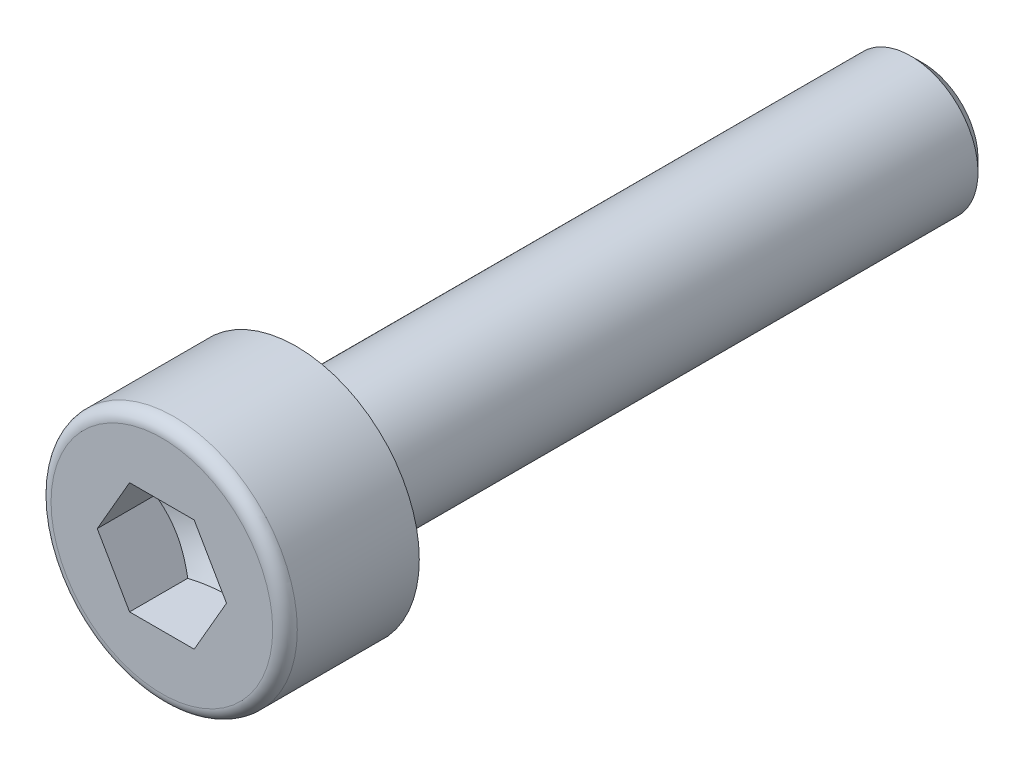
ISO-10303-21;
HEADER;
FILE_DESCRIPTION(('STEP AP214'),'2;1');
FILE_NAME('part.step','',(''),(''),'','','');
FILE_SCHEMA(('AUTOMOTIVE_DESIGN { 1 0 10303 214 1 1 1 1 }'));
ENDSEC;
DATA;
#1=APPLICATION_CONTEXT('core data for automotive mechanical design processes');
#2=APPLICATION_PROTOCOL_DEFINITION('international standard','automotive_design',2000,#1);
#3=PRODUCT_CONTEXT('',#1,'mechanical');
#4=PRODUCT('Part','Part','',(#3));
#5=PRODUCT_RELATED_PRODUCT_CATEGORY('part','',(#4));
#6=PRODUCT_DEFINITION_FORMATION('','',#4);
#7=PRODUCT_DEFINITION_CONTEXT('part definition',#1,'design');
#8=PRODUCT_DEFINITION('design','',#6,#7);
#9=PRODUCT_DEFINITION_SHAPE('','',#8);
#10=(LENGTH_UNIT() NAMED_UNIT(*) SI_UNIT(.MILLI.,.METRE.));
#11=(NAMED_UNIT(*) PLANE_ANGLE_UNIT() SI_UNIT($,.RADIAN.));
#12=(NAMED_UNIT(*) SI_UNIT($,.STERADIAN.) SOLID_ANGLE_UNIT());
#13=UNCERTAINTY_MEASURE_WITH_UNIT(LENGTH_MEASURE(1.E-05),#10,'distance_accuracy_value','');
#14=(GEOMETRIC_REPRESENTATION_CONTEXT(3) GLOBAL_UNCERTAINTY_ASSIGNED_CONTEXT((#13)) GLOBAL_UNIT_ASSIGNED_CONTEXT((#10,
#11,#12)) REPRESENTATION_CONTEXT('',''));
#15=CARTESIAN_POINT('',(0.,0.,0.));
#16=DIRECTION('',(0.,0.,1.));
#17=DIRECTION('',(1.,0.,0.));
#18=AXIS2_PLACEMENT_3D('',#15,#16,#17);
#19=CARTESIAN_POINT('',(0.,1.2375,3.));
#20=DIRECTION('',(0.,0.,1.));
#21=DIRECTION('',(1.,0.,0.));
#22=AXIS2_PLACEMENT_3D('',#19,#20,#21);
#23=PLANE('',#22);
#24=DIRECTION('',(-0.5,0.866025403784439,0.));
#25=VECTOR('',#24,1.);
#26=CARTESIAN_POINT('',(-1.35045785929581,-0.160937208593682,3.));
#27=LINE('',#26,#25);
#28=CARTESIAN_POINT('',(-0.7216875,-1.24999941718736,3.));
#29=VERTEX_POINT('',#28);
#30=CARTESIAN_POINT('',(-1.443375,0.,3.));
#31=VERTEX_POINT('',#30);
#32=EDGE_CURVE('E145',#29,#31,#27,.T.);
#33=ORIENTED_EDGE('',*,*,#32,.T.);
#34=DIRECTION('',(0.5,0.866025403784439,0.));
#35=VECTOR('',#34,1.);
#36=CARTESIAN_POINT('',(-0.81460464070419,1.08906220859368,3.));
#37=LINE('',#36,#35);
#38=CARTESIAN_POINT('',(-0.7216875,1.24999941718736,3.));
#39=VERTEX_POINT('',#38);
#40=EDGE_CURVE('E10',#31,#39,#37,.T.);
#41=ORIENTED_EDGE('',*,*,#40,.T.);
#42=DIRECTION('',(1.,0.,0.));
#43=VECTOR('',#42,1.);
#44=CARTESIAN_POINT('',(0.,1.24999941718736,3.));
#45=LINE('',#44,#43);
#46=CARTESIAN_POINT('',(0.7216875,1.24999941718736,3.));
#47=VERTEX_POINT('',#46);
#48=EDGE_CURVE('E176',#39,#47,#45,.T.);
#49=ORIENTED_EDGE('',*,*,#48,.T.);
#50=DIRECTION('',(0.5,-0.866025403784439,0.));
#51=VECTOR('',#50,1.);
#52=CARTESIAN_POINT('',(0.814604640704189,1.08906220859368,3.));
#53=LINE('',#52,#51);
#54=CARTESIAN_POINT('',(1.443375,0.,3.));
#55=VERTEX_POINT('',#54);
#56=EDGE_CURVE('E172',#47,#55,#53,.T.);
#57=ORIENTED_EDGE('',*,*,#56,.T.);
#58=DIRECTION('',(-0.5,-0.866025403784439,0.));
#59=VECTOR('',#58,1.);
#60=CARTESIAN_POINT('',(1.35045785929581,-0.160937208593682,3.));
#61=LINE('',#60,#59);
#62=CARTESIAN_POINT('',(0.7216875,-1.24999941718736,3.));
#63=VERTEX_POINT('',#62);
#64=EDGE_CURVE('E173',#55,#63,#61,.T.);
#65=ORIENTED_EDGE('',*,*,#64,.T.);
#66=DIRECTION('',(-1.,0.,0.));
#67=VECTOR('',#66,1.);
#68=CARTESIAN_POINT('',(0.,-1.24999941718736,3.));
#69=LINE('',#68,#67);
#70=EDGE_CURVE('E147',#63,#29,#69,.T.);
#71=ORIENTED_EDGE('',*,*,#70,.T.);
#72=EDGE_LOOP('',(#33,#41,#49,#57,#65,#71));
#73=FACE_BOUND('',#72,.T.);
#74=CARTESIAN_POINT('',(0.,0.,3.));
#75=DIRECTION('',(0.,0.,-1.));
#76=DIRECTION('',(0.,1.,0.));
#77=AXIS2_PLACEMENT_3D('',#74,#75,#76);
#78=CIRCLE('',#77,2.475);
#79=CARTESIAN_POINT('',(2.475,0.,3.));
#80=VERTEX_POINT('',#79);
#81=EDGE_CURVE('E194',#80,#80,#78,.T.);
#82=ORIENTED_EDGE('',*,*,#81,.F.);
#83=EDGE_LOOP('',(#82));
#84=FACE_BOUND('',#83,.T.);
#85=ADVANCED_FACE('F16',(#73,#84),#23,.T.);
#86=CARTESIAN_POINT('',(0.,0.6146875,-14.));
#87=DIRECTION('',(0.,0.,-1.));
#88=DIRECTION('',(0.,-1.,0.));
#89=AXIS2_PLACEMENT_3D('',#86,#87,#88);
#90=PLANE('',#89);
#91=CARTESIAN_POINT('',(0.,0.,-14.));
#92=DIRECTION('',(0.,0.,-1.));
#93=DIRECTION('',(0.,1.,0.));
#94=AXIS2_PLACEMENT_3D('',#91,#92,#93);
#95=CIRCLE('',#94,1.229375);
#96=CARTESIAN_POINT('',(0.,-1.229375,-14.));
#97=VERTEX_POINT('',#96);
#98=EDGE_CURVE('E180',#97,#97,#95,.T.);
#99=ORIENTED_EDGE('',*,*,#98,.T.);
#100=EDGE_LOOP('',(#99));
#101=FACE_BOUND('',#100,.T.);
#102=ADVANCED_FACE('F281',(#101),#90,.T.);
#103=CARTESIAN_POINT('',(0.,2.2,0.));
#104=DIRECTION('',(0.,0.,-1.));
#105=DIRECTION('',(0.,-1.,0.));
#106=AXIS2_PLACEMENT_3D('',#103,#104,#105);
#107=PLANE('',#106);
#108=CARTESIAN_POINT('',(0.,0.,0.));
#109=DIRECTION('',(0.,0.,-1.));
#110=DIRECTION('',(0.,1.,0.));
#111=AXIS2_PLACEMENT_3D('',#108,#109,#110);
#112=CIRCLE('',#111,1.65);
#113=CARTESIAN_POINT('',(0.,1.65,0.));
#114=VERTEX_POINT('',#113);
#115=EDGE_CURVE('E214',#114,#114,#112,.T.);
#116=ORIENTED_EDGE('',*,*,#115,.F.);
#117=EDGE_LOOP('',(#116));
#118=FACE_BOUND('',#117,.T.);
#119=CARTESIAN_POINT('',(0.,0.,0.));
#120=DIRECTION('',(0.,0.,-1.));
#121=DIRECTION('',(0.,1.,0.));
#122=AXIS2_PLACEMENT_3D('',#119,#120,#121);
#123=CIRCLE('',#122,2.75);
#124=CARTESIAN_POINT('',(0.,-2.75,0.));
#125=VERTEX_POINT('',#124);
#126=EDGE_CURVE('E195',#125,#125,#123,.T.);
#127=ORIENTED_EDGE('',*,*,#126,.T.);
#128=EDGE_LOOP('',(#127));
#129=FACE_BOUND('',#128,.T.);
#130=ADVANCED_FACE('F286',(#118,#129),#107,.T.);
#131=CARTESIAN_POINT('',(-1.08253125,0.624999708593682,3.));
#132=DIRECTION('',(-0.866025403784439,0.5,0.));
#133=DIRECTION('',(0.,0.,1.));
#134=AXIS2_PLACEMENT_3D('',#131,#132,#133);
#135=PLANE('',#134);
#136=CARTESIAN_POINT('',(-1.443375,0.,1.7));
#137=CARTESIAN_POINT('',(-1.08253125,0.624999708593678,1.49166676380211));
#138=CARTESIAN_POINT('',(-0.7216875,1.24999941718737,1.7));
#139=(BOUNDED_CURVE() B_SPLINE_CURVE(2,(#136,#137,#138),.UNSPECIFIED.,.F.,
.F.) B_SPLINE_CURVE_WITH_KNOTS((3,3),(0.,1.46054449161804),
.UNSPECIFIED.) CURVE() GEOMETRIC_REPRESENTATION_ITEM() RATIONAL_B_SPLINE_CURVE((1.,
1.15470053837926,1.)) REPRESENTATION_ITEM(''));
#140=CARTESIAN_POINT('',(-1.443375,0.,1.7));
#141=VERTEX_POINT('',#140);
#142=CARTESIAN_POINT('',(-0.7216875,1.24999941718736,1.7));
#143=VERTEX_POINT('',#142);
#144=EDGE_CURVE('E20',#141,#143,#139,.T.);
#145=ORIENTED_EDGE('',*,*,#144,.T.);
#146=DIRECTION('',(0.,0.,-1.));
#147=VECTOR('',#146,1.);
#148=CARTESIAN_POINT('',(-0.7216875,1.24999941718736,3.));
#149=LINE('',#148,#147);
#150=EDGE_CURVE('E29',#39,#143,#149,.T.);
#151=ORIENTED_EDGE('',*,*,#150,.F.);
#152=ORIENTED_EDGE('',*,*,#40,.F.);
#153=DIRECTION('',(0.,0.,-1.));
#154=VECTOR('',#153,1.);
#155=CARTESIAN_POINT('',(-1.443375,0.,3.));
#156=LINE('',#155,#154);
#157=EDGE_CURVE('E223',#31,#141,#156,.T.);
#158=ORIENTED_EDGE('',*,*,#157,.T.);
#159=EDGE_LOOP('',(#145,#151,#152,#158));
#160=FACE_BOUND('',#159,.T.);
#161=ADVANCED_FACE('F265',(#160),#135,.F.);
#162=CARTESIAN_POINT('',(0.,1.24999941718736,3.));
#163=DIRECTION('',(0.,1.,0.));
#164=DIRECTION('',(1.,0.,0.));
#165=AXIS2_PLACEMENT_3D('',#162,#163,#164);
#166=PLANE('',#165);
#167=CARTESIAN_POINT('',(-0.7216875,1.24999941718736,1.7));
#168=CARTESIAN_POINT('',(-0.334936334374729,1.24999941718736,1.58835455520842));
#169=CARTESIAN_POINT('',(0.,1.24999941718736,1.58835455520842));
#170=(BOUNDED_CURVE() B_SPLINE_CURVE(2,(#167,#168,#169),.UNSPECIFIED.,.F.,
.F.) B_SPLINE_CURVE_WITH_KNOTS((3,3),(0.,0.730272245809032),
.UNSPECIFIED.) CURVE() GEOMETRIC_REPRESENTATION_ITEM() RATIONAL_B_SPLINE_CURVE((1.,
1.07735026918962,1.07735026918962)) REPRESENTATION_ITEM(''));
#171=CARTESIAN_POINT('',(0.,1.24999941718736,1.58835455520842));
#172=VERTEX_POINT('',#171);
#173=EDGE_CURVE('E164',#143,#172,#170,.T.);
#174=ORIENTED_EDGE('',*,*,#173,.T.);
#175=CARTESIAN_POINT('',(0.,1.24999941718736,1.58835455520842));
#176=CARTESIAN_POINT('',(0.33493633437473,1.24999941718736,1.58835455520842));
#177=CARTESIAN_POINT('',(0.7216875,1.24999941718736,1.7));
#178=(BOUNDED_CURVE() B_SPLINE_CURVE(2,(#175,#176,#177),.UNSPECIFIED.,.F.,
.F.) B_SPLINE_CURVE_WITH_KNOTS((3,3),(0.730272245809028,1.46054449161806),
.UNSPECIFIED.) CURVE() GEOMETRIC_REPRESENTATION_ITEM() RATIONAL_B_SPLINE_CURVE((1.07735026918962,
1.07735026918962,1.)) REPRESENTATION_ITEM(''));
#179=CARTESIAN_POINT('',(0.7216875,1.24999941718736,1.7));
#180=VERTEX_POINT('',#179);
#181=EDGE_CURVE('E186',#172,#180,#178,.T.);
#182=ORIENTED_EDGE('',*,*,#181,.T.);
#183=DIRECTION('',(0.,0.,-1.));
#184=VECTOR('',#183,1.);
#185=CARTESIAN_POINT('',(0.7216875,1.24999941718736,3.));
#186=LINE('',#185,#184);
#187=EDGE_CURVE('E80',#47,#180,#186,.T.);
#188=ORIENTED_EDGE('',*,*,#187,.F.);
#189=ORIENTED_EDGE('',*,*,#48,.F.);
#190=ORIENTED_EDGE('',*,*,#150,.T.);
#191=EDGE_LOOP('',(#174,#182,#188,#189,#190));
#192=FACE_BOUND('',#191,.T.);
#193=ADVANCED_FACE('F266',(#192),#166,.F.);
#194=CARTESIAN_POINT('',(1.08253125,0.624999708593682,3.));
#195=DIRECTION('',(0.866025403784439,0.5,0.));
#196=DIRECTION('',(0.,0.,-1.));
#197=AXIS2_PLACEMENT_3D('',#194,#195,#196);
#198=PLANE('',#197);
#199=CARTESIAN_POINT('',(0.7216875,1.24999941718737,1.7));
#200=CARTESIAN_POINT('',(1.08253125,0.624999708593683,1.49166676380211));
#201=CARTESIAN_POINT('',(1.443375,0.,1.7));
#202=(BOUNDED_CURVE() B_SPLINE_CURVE(2,(#199,#200,#201),.UNSPECIFIED.,.F.,
.F.) B_SPLINE_CURVE_WITH_KNOTS((3,3),(0.,1.46054449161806),
.UNSPECIFIED.) CURVE() GEOMETRIC_REPRESENTATION_ITEM() RATIONAL_B_SPLINE_CURVE((1.,
1.15470053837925,1.)) REPRESENTATION_ITEM(''));
#203=CARTESIAN_POINT('',(1.443375,0.,1.7));
#204=VERTEX_POINT('',#203);
#205=EDGE_CURVE('E201',#180,#204,#202,.T.);
#206=ORIENTED_EDGE('',*,*,#205,.T.);
#207=DIRECTION('',(0.,0.,-1.));
#208=VECTOR('',#207,1.);
#209=CARTESIAN_POINT('',(1.443375,0.,3.));
#210=LINE('',#209,#208);
#211=EDGE_CURVE('E95',#55,#204,#210,.T.);
#212=ORIENTED_EDGE('',*,*,#211,.F.);
#213=ORIENTED_EDGE('',*,*,#56,.F.);
#214=ORIENTED_EDGE('',*,*,#187,.T.);
#215=EDGE_LOOP('',(#206,#212,#213,#214));
#216=FACE_BOUND('',#215,.T.);
#217=ADVANCED_FACE('F267',(#216),#198,.F.);
#218=CARTESIAN_POINT('',(1.08253125,-0.624999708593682,3.));
#219=DIRECTION('',(0.866025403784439,-0.5,0.));
#220=DIRECTION('',(0.,0.,-1.));
#221=AXIS2_PLACEMENT_3D('',#218,#219,#220);
#222=PLANE('',#221);
#223=CARTESIAN_POINT('',(1.443375,0.,1.7));
#224=CARTESIAN_POINT('',(1.08253125,-0.624999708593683,1.49166676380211));
#225=CARTESIAN_POINT('',(0.7216875,-1.24999941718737,1.7));
#226=(BOUNDED_CURVE() B_SPLINE_CURVE(2,(#223,#224,#225),.UNSPECIFIED.,.F.,
.F.) B_SPLINE_CURVE_WITH_KNOTS((3,3),(0.,1.46054449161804),
.UNSPECIFIED.) CURVE() GEOMETRIC_REPRESENTATION_ITEM() RATIONAL_B_SPLINE_CURVE((1.,
1.15470053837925,1.)) REPRESENTATION_ITEM(''));
#227=CARTESIAN_POINT('',(0.7216875,-1.24999941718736,1.7));
#228=VERTEX_POINT('',#227);
#229=EDGE_CURVE('E196',#204,#228,#226,.T.);
#230=ORIENTED_EDGE('',*,*,#229,.T.);
#231=DIRECTION('',(0.,0.,-1.));
#232=VECTOR('',#231,1.);
#233=CARTESIAN_POINT('',(0.7216875,-1.24999941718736,3.));
#234=LINE('',#233,#232);
#235=EDGE_CURVE('E107',#63,#228,#234,.T.);
#236=ORIENTED_EDGE('',*,*,#235,.F.);
#237=ORIENTED_EDGE('',*,*,#64,.F.);
#238=ORIENTED_EDGE('',*,*,#211,.T.);
#239=EDGE_LOOP('',(#230,#236,#237,#238));
#240=FACE_BOUND('',#239,.T.);
#241=ADVANCED_FACE('F269',(#240),#222,.F.);
#242=CARTESIAN_POINT('',(0.,-1.24999941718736,3.));
#243=DIRECTION('',(0.,-1.,0.));
#244=DIRECTION('',(0.,0.,-1.));
#245=AXIS2_PLACEMENT_3D('',#242,#243,#244);
#246=PLANE('',#245);
#247=CARTESIAN_POINT('',(0.7216875,-1.24999941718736,1.7));
#248=CARTESIAN_POINT('',(0.33493633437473,-1.24999941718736,1.58835455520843));
#249=CARTESIAN_POINT('',(0.,-1.24999941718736,1.58835455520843));
#250=(BOUNDED_CURVE() B_SPLINE_CURVE(2,(#247,#248,#249),.UNSPECIFIED.,.F.,
.F.) B_SPLINE_CURVE_WITH_KNOTS((3,3),(0.,0.730272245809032),
.UNSPECIFIED.) CURVE() GEOMETRIC_REPRESENTATION_ITEM() RATIONAL_B_SPLINE_CURVE((1.,
1.07735026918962,1.07735026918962)) REPRESENTATION_ITEM(''));
#251=CARTESIAN_POINT('',(0.,-1.24999941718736,1.58835455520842));
#252=VERTEX_POINT('',#251);
#253=EDGE_CURVE('E153',#228,#252,#250,.T.);
#254=ORIENTED_EDGE('',*,*,#253,.T.);
#255=CARTESIAN_POINT('',(0.,-1.24999941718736,1.58835455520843));
#256=CARTESIAN_POINT('',(-0.33493633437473,-1.24999941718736,1.58835455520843));
#257=CARTESIAN_POINT('',(-0.7216875,-1.24999941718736,1.7));
#258=(BOUNDED_CURVE() B_SPLINE_CURVE(2,(#255,#256,#257),.UNSPECIFIED.,.F.,
.F.) B_SPLINE_CURVE_WITH_KNOTS((3,3),(0.730272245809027,1.46054449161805),
.UNSPECIFIED.) CURVE() GEOMETRIC_REPRESENTATION_ITEM() RATIONAL_B_SPLINE_CURVE((1.07735026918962,
1.07735026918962,1.)) REPRESENTATION_ITEM(''));
#259=CARTESIAN_POINT('',(-0.7216875,-1.24999941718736,1.7));
#260=VERTEX_POINT('',#259);
#261=EDGE_CURVE('E150',#252,#260,#258,.T.);
#262=ORIENTED_EDGE('',*,*,#261,.T.);
#263=DIRECTION('',(0.,0.,-1.));
#264=VECTOR('',#263,1.);
#265=CARTESIAN_POINT('',(-0.7216875,-1.24999941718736,3.));
#266=LINE('',#265,#264);
#267=EDGE_CURVE('E139',#29,#260,#266,.T.);
#268=ORIENTED_EDGE('',*,*,#267,.F.);
#269=ORIENTED_EDGE('',*,*,#70,.F.);
#270=ORIENTED_EDGE('',*,*,#235,.T.);
#271=EDGE_LOOP('',(#254,#262,#268,#269,#270));
#272=FACE_BOUND('',#271,.T.);
#273=ADVANCED_FACE('F151',(#272),#246,.F.);
#274=CARTESIAN_POINT('',(-1.08253125,-0.624999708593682,3.));
#275=DIRECTION('',(-0.866025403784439,-0.5,0.));
#276=DIRECTION('',(-0.5,0.866025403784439,0.));
#277=AXIS2_PLACEMENT_3D('',#274,#275,#276);
#278=PLANE('',#277);
#279=CARTESIAN_POINT('',(-0.7216875,-1.24999941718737,1.7));
#280=CARTESIAN_POINT('',(-1.08253125,-0.624999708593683,1.49166676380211));
#281=CARTESIAN_POINT('',(-1.443375,0.,1.7));
#282=(BOUNDED_CURVE() B_SPLINE_CURVE(2,(#279,#280,#281),.UNSPECIFIED.,.F.,
.F.) B_SPLINE_CURVE_WITH_KNOTS((3,3),(0.,1.46054449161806),
.UNSPECIFIED.) CURVE() GEOMETRIC_REPRESENTATION_ITEM() RATIONAL_B_SPLINE_CURVE((1.,
1.15470053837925,1.)) REPRESENTATION_ITEM(''));
#283=EDGE_CURVE('E143',#260,#141,#282,.T.);
#284=ORIENTED_EDGE('',*,*,#283,.T.);
#285=ORIENTED_EDGE('',*,*,#157,.F.);
#286=ORIENTED_EDGE('',*,*,#32,.F.);
#287=ORIENTED_EDGE('',*,*,#267,.T.);
#288=EDGE_LOOP('',(#284,#285,#286,#287));
#289=FACE_BOUND('',#288,.T.);
#290=ADVANCED_FACE('F18',(#289),#278,.F.);
#291=CARTESIAN_POINT('',(0.,0.,1.28333352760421));
#292=DIRECTION('',(0.,0.,1.));
#293=DIRECTION('',(0.,1.,0.));
#294=AXIS2_PLACEMENT_3D('',#291,#292,#293);
#295=CONICAL_SURFACE('',#294,0.7216875,1.0471975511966);
#296=CARTESIAN_POINT('',(0.,0.,0.866667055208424));
#297=VERTEX_POINT('',#296);
#298=VERTEX_LOOP('',#297);
#299=FACE_BOUND('',#298,.T.);
#300=ORIENTED_EDGE('',*,*,#181,.F.);
#301=ORIENTED_EDGE('',*,*,#173,.F.);
#302=ORIENTED_EDGE('',*,*,#144,.F.);
#303=ORIENTED_EDGE('',*,*,#283,.F.);
#304=ORIENTED_EDGE('',*,*,#261,.F.);
#305=ORIENTED_EDGE('',*,*,#253,.F.);
#306=ORIENTED_EDGE('',*,*,#229,.F.);
#307=ORIENTED_EDGE('',*,*,#205,.F.);
#308=EDGE_LOOP('',(#300,#301,#302,#303,#304,#305,#306,#307));
#309=FACE_BOUND('',#308,.T.);
#310=ADVANCED_FACE('F158',(#299,#309),#295,.F.);
#311=CARTESIAN_POINT('',(0.,0.,2.725));
#312=DIRECTION('',(0.,0.,-1.));
#313=DIRECTION('',(-1.,0.,0.));
#314=AXIS2_PLACEMENT_3D('',#311,#312,#313);
#315=TOROIDAL_SURFACE('',#314,2.475,0.275);
#316=ORIENTED_EDGE('',*,*,#81,.T.);
#317=EDGE_LOOP('',(#316));
#318=FACE_BOUND('',#317,.T.);
#319=CARTESIAN_POINT('',(0.,0.,2.725));
#320=DIRECTION('',(0.,0.,-1.));
#321=DIRECTION('',(0.,1.,0.));
#322=AXIS2_PLACEMENT_3D('',#319,#320,#321);
#323=CIRCLE('',#322,2.75);
#324=CARTESIAN_POINT('',(-2.75,0.,2.725));
#325=VERTEX_POINT('',#324);
#326=EDGE_CURVE('E187',#325,#325,#323,.T.);
#327=ORIENTED_EDGE('',*,*,#326,.F.);
#328=EDGE_LOOP('',(#327));
#329=FACE_BOUND('',#328,.T.);
#330=ADVANCED_FACE('F298',(#318,#329),#315,.T.);
#331=CARTESIAN_POINT('',(0.,0.,1.3625));
#332=DIRECTION('',(0.,0.,-1.));
#333=DIRECTION('',(0.,1.,0.));
#334=AXIS2_PLACEMENT_3D('',#331,#332,#333);
#335=CYLINDRICAL_SURFACE('',#334,2.75);
#336=ORIENTED_EDGE('',*,*,#326,.T.);
#337=EDGE_LOOP('',(#336));
#338=FACE_BOUND('',#337,.T.);
#339=ORIENTED_EDGE('',*,*,#126,.F.);
#340=EDGE_LOOP('',(#339));
#341=FACE_BOUND('',#340,.T.);
#342=ADVANCED_FACE('F301',(#338,#341),#335,.T.);
#343=CARTESIAN_POINT('',(0.,0.,-0.15));
#344=DIRECTION('',(0.,0.,-1.));
#345=DIRECTION('',(-1.,0.,0.));
#346=AXIS2_PLACEMENT_3D('',#343,#344,#345);
#347=TOROIDAL_SURFACE('',#346,1.65,0.15);
#348=ORIENTED_EDGE('',*,*,#115,.T.);
#349=EDGE_LOOP('',(#348));
#350=FACE_BOUND('',#349,.T.);
#351=CARTESIAN_POINT('',(0.,0.,-0.15));
#352=DIRECTION('',(0.,0.,-1.));
#353=DIRECTION('',(0.,1.,0.));
#354=AXIS2_PLACEMENT_3D('',#351,#352,#353);
#355=CIRCLE('',#354,1.5);
#356=CARTESIAN_POINT('',(-1.5,0.,-0.15));
#357=VERTEX_POINT('',#356);
#358=EDGE_CURVE('E179',#357,#357,#355,.T.);
#359=ORIENTED_EDGE('',*,*,#358,.F.);
#360=EDGE_LOOP('',(#359));
#361=FACE_BOUND('',#360,.T.);
#362=ADVANCED_FACE('F296',(#350,#361),#347,.F.);
#363=CARTESIAN_POINT('',(0.,0.,-6.9396875));
#364=DIRECTION('',(0.,0.,-1.));
#365=DIRECTION('',(0.,1.,0.));
#366=AXIS2_PLACEMENT_3D('',#363,#364,#365);
#367=CYLINDRICAL_SURFACE('',#366,1.5);
#368=ORIENTED_EDGE('',*,*,#358,.T.);
#369=EDGE_LOOP('',(#368));
#370=FACE_BOUND('',#369,.T.);
#371=CARTESIAN_POINT('',(0.,0.,-13.729375));
#372=DIRECTION('',(0.,0.,-1.));
#373=DIRECTION('',(0.,1.,0.));
#374=AXIS2_PLACEMENT_3D('',#371,#372,#373);
#375=CIRCLE('',#374,1.5);
#376=CARTESIAN_POINT('',(0.,-1.5,-13.729375));
#377=VERTEX_POINT('',#376);
#378=EDGE_CURVE('E177',#377,#377,#375,.T.);
#379=ORIENTED_EDGE('',*,*,#378,.F.);
#380=EDGE_LOOP('',(#379));
#381=FACE_BOUND('',#380,.T.);
#382=ADVANCED_FACE('F292',(#370,#381),#367,.T.);
#383=CARTESIAN_POINT('',(0.,0.,-13.8646875));
#384=DIRECTION('',(0.,0.,1.));
#385=DIRECTION('',(0.,1.,0.));
#386=AXIS2_PLACEMENT_3D('',#383,#384,#385);
#387=CONICAL_SURFACE('',#386,1.3646875,0.78539816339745);
#388=ORIENTED_EDGE('',*,*,#378,.T.);
#389=EDGE_LOOP('',(#388));
#390=FACE_BOUND('',#389,.T.);
#391=ORIENTED_EDGE('',*,*,#98,.F.);
#392=EDGE_LOOP('',(#391));
#393=FACE_BOUND('',#392,.T.);
#394=ADVANCED_FACE('F295',(#390,#393),#387,.T.);
#395=CLOSED_SHELL('',(#85,#102,#130,#161,#193,#217,#241,#273,#290,#310,#330,#342,#362,#382,#394));
#396=MANIFOLD_SOLID_BREP('B1',#395);
#397=ADVANCED_BREP_SHAPE_REPRESENTATION('',(#18,#396),#14);
#398=SHAPE_DEFINITION_REPRESENTATION(#9,#397);
ENDSEC;
END-ISO-10303-21;
